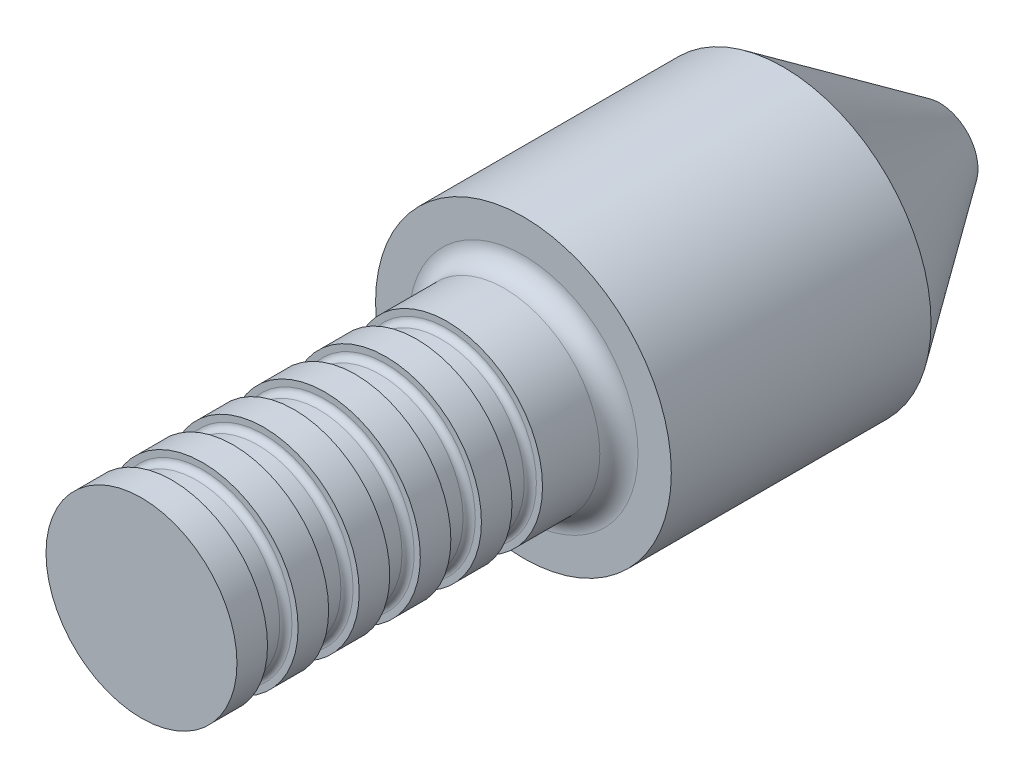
ISO-10303-21;
HEADER;
FILE_DESCRIPTION(('STEP AP214'),'2;1');
FILE_NAME('part.step','',(''),(''),'','','');
FILE_SCHEMA(('AUTOMOTIVE_DESIGN { 1 0 10303 214 1 1 1 1 }'));
ENDSEC;
DATA;
#1=APPLICATION_CONTEXT('core data for automotive mechanical design processes');
#2=APPLICATION_PROTOCOL_DEFINITION('international standard','automotive_design',2000,#1);
#3=PRODUCT_CONTEXT('',#1,'mechanical');
#4=PRODUCT('Part','Part','',(#3));
#5=PRODUCT_RELATED_PRODUCT_CATEGORY('part','',(#4));
#6=PRODUCT_DEFINITION_FORMATION('','',#4);
#7=PRODUCT_DEFINITION_CONTEXT('part definition',#1,'design');
#8=PRODUCT_DEFINITION('design','',#6,#7);
#9=PRODUCT_DEFINITION_SHAPE('','',#8);
#10=(LENGTH_UNIT() NAMED_UNIT(*) SI_UNIT(.MILLI.,.METRE.));
#11=(NAMED_UNIT(*) PLANE_ANGLE_UNIT() SI_UNIT($,.RADIAN.));
#12=(NAMED_UNIT(*) SI_UNIT($,.STERADIAN.) SOLID_ANGLE_UNIT());
#13=UNCERTAINTY_MEASURE_WITH_UNIT(LENGTH_MEASURE(1.E-05),#10,'distance_accuracy_value','');
#14=(GEOMETRIC_REPRESENTATION_CONTEXT(3) GLOBAL_UNCERTAINTY_ASSIGNED_CONTEXT((#13)) GLOBAL_UNIT_ASSIGNED_CONTEXT((#10,
#11,#12)) REPRESENTATION_CONTEXT('',''));
#15=CARTESIAN_POINT('',(0.,0.,0.));
#16=DIRECTION('',(0.,0.,1.));
#17=DIRECTION('',(1.,0.,0.));
#18=AXIS2_PLACEMENT_3D('',#15,#16,#17);
#19=CARTESIAN_POINT('',(0.,0.,-30.6399889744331));
#20=DIRECTION('',(0.,0.,-1.));
#21=DIRECTION('',(-1.,0.,0.));
#22=AXIS2_PLACEMENT_3D('',#19,#20,#21);
#23=CONICAL_SURFACE('',#22,0.,1.02974425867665);
#24=CARTESIAN_POINT('',(0.,0.,-31.5938552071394));
#25=DIRECTION('',(0.,0.,1.));
#26=DIRECTION('',(1.,0.,0.));
#27=AXIS2_PLACEMENT_3D('',#24,#25,#26);
#28=CIRCLE('',#27,1.5875);
#29=CARTESIAN_POINT('',(1.5875,0.,-31.5938552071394));
#30=VERTEX_POINT('',#29);
#31=EDGE_CURVE('E11',#30,#30,#28,.T.);
#32=ORIENTED_EDGE('',*,*,#31,.F.);
#33=EDGE_LOOP('',(#32));
#34=FACE_BOUND('',#33,.T.);
#35=CARTESIAN_POINT('',(0.,0.,-30.6399889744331));
#36=VERTEX_POINT('',#35);
#37=VERTEX_LOOP('',#36);
#38=FACE_BOUND('',#37,.T.);
#39=ADVANCED_FACE('F33',(#34,#38),#23,.F.);
#40=CARTESIAN_POINT('',(0.,0.,0.));
#41=DIRECTION('',(0.,0.,1.));
#42=DIRECTION('',(1.,0.,0.));
#43=AXIS2_PLACEMENT_3D('',#40,#41,#42);
#44=CYLINDRICAL_SURFACE('',#43,1.5875);
#45=CARTESIAN_POINT('',(0.,0.,-33.1813552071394));
#46=DIRECTION('',(0.,0.,1.));
#47=DIRECTION('',(1.,0.,0.));
#48=AXIS2_PLACEMENT_3D('',#45,#46,#47);
#49=CIRCLE('',#48,1.5875);
#50=CARTESIAN_POINT('',(1.5875,0.,-33.1813552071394));
#51=VERTEX_POINT('',#50);
#52=EDGE_CURVE('E39',#51,#51,#49,.T.);
#53=ORIENTED_EDGE('',*,*,#52,.F.);
#54=EDGE_LOOP('',(#53));
#55=FACE_BOUND('',#54,.T.);
#56=ORIENTED_EDGE('',*,*,#31,.T.);
#57=EDGE_LOOP('',(#56));
#58=FACE_BOUND('',#57,.T.);
#59=ADVANCED_FACE('F43',(#55,#58),#44,.F.);
#60=CARTESIAN_POINT('',(0.,0.,-33.1813552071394));
#61=DIRECTION('',(0.,0.,1.));
#62=DIRECTION('',(1.,0.,0.));
#63=AXIS2_PLACEMENT_3D('',#60,#61,#62);
#64=CONICAL_SURFACE('',#63,1.5875,0.61086523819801);
#65=CARTESIAN_POINT('',(0.,0.,-26.67));
#66=DIRECTION('',(0.,0.,1.));
#67=DIRECTION('',(1.,0.,0.));
#68=AXIS2_PLACEMENT_3D('',#65,#66,#67);
#69=CIRCLE('',#68,6.1468);
#70=CARTESIAN_POINT('',(6.1468,0.,-26.67));
#71=VERTEX_POINT('',#70);
#72=EDGE_CURVE('E304',#71,#71,#69,.T.);
#73=CARTESIAN_POINT('',(6.1468,0.,-26.67));
#74=CARTESIAN_POINT('',(6.09930729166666,0.,-26.737826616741));
#75=CARTESIAN_POINT('',(6.05181458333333,0.,-26.8056532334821));
#76=CARTESIAN_POINT('',(5.95682916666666,0.,-26.9413064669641));
#77=CARTESIAN_POINT('',(5.90933645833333,0.,-27.0091330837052));
#78=CARTESIAN_POINT('',(5.81435104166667,0.,-27.1447863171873));
#79=CARTESIAN_POINT('',(5.76685833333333,0.,-27.2126129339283));
#80=CARTESIAN_POINT('',(5.67187291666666,0.,-27.3482661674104));
#81=CARTESIAN_POINT('',(5.62438020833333,0.,-27.4160927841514));
#82=CARTESIAN_POINT('',(5.52939479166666,0.,-27.5517460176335));
#83=CARTESIAN_POINT('',(5.48190208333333,0.,-27.6195726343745));
#84=CARTESIAN_POINT('',(5.38691666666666,0.,-27.7552258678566));
#85=CARTESIAN_POINT('',(5.33942395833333,0.,-27.8230524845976));
#86=CARTESIAN_POINT('',(5.24443854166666,0.,-27.9587057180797));
#87=CARTESIAN_POINT('',(5.19694583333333,0.,-28.0265323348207));
#88=CARTESIAN_POINT('',(5.10196041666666,0.,-28.1621855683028));
#89=CARTESIAN_POINT('',(5.05446770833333,0.,-28.2300121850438));
#90=CARTESIAN_POINT('',(4.95948229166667,0.,-28.3656654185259));
#91=CARTESIAN_POINT('',(4.91198958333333,0.,-28.4334920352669));
#92=CARTESIAN_POINT('',(4.81700416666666,0.,-28.569145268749));
#93=CARTESIAN_POINT('',(4.76951145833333,0.,-28.63697188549));
#94=CARTESIAN_POINT('',(4.67452604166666,0.,-28.7726251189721));
#95=CARTESIAN_POINT('',(4.62703333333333,0.,-28.8404517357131));
#96=CARTESIAN_POINT('',(4.53204791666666,0.,-28.9761049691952));
#97=CARTESIAN_POINT('',(4.48455520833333,0.,-29.0439315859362));
#98=CARTESIAN_POINT('',(4.38956979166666,0.,-29.1795848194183));
#99=CARTESIAN_POINT('',(4.34207708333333,0.,-29.2474114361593));
#100=CARTESIAN_POINT('',(4.24709166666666,0.,-29.3830646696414));
#101=CARTESIAN_POINT('',(4.19959895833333,0.,-29.4508912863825));
#102=CARTESIAN_POINT('',(4.10461354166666,0.,-29.5865445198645));
#103=CARTESIAN_POINT('',(4.05712083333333,0.,-29.6543711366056));
#104=CARTESIAN_POINT('',(3.96213541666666,0.,-29.7900243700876));
#105=CARTESIAN_POINT('',(3.91464270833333,0.,-29.8578509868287));
#106=CARTESIAN_POINT('',(3.81965729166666,0.,-29.9935042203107));
#107=CARTESIAN_POINT('',(3.77216458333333,0.,-30.0613308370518));
#108=CARTESIAN_POINT('',(3.67717916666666,0.,-30.1969840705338));
#109=CARTESIAN_POINT('',(3.62968645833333,0.,-30.2648106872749));
#110=CARTESIAN_POINT('',(3.53470104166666,0.,-30.4004639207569));
#111=CARTESIAN_POINT('',(3.48720833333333,0.,-30.468290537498));
#112=CARTESIAN_POINT('',(3.39222291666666,0.,-30.6039437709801));
#113=CARTESIAN_POINT('',(3.34473020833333,0.,-30.6717703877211));
#114=CARTESIAN_POINT('',(3.24974479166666,0.,-30.8074236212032));
#115=CARTESIAN_POINT('',(3.20225208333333,0.,-30.8752502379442));
#116=CARTESIAN_POINT('',(3.10726666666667,0.,-31.0109034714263));
#117=CARTESIAN_POINT('',(3.05977395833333,0.,-31.0787300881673));
#118=CARTESIAN_POINT('',(2.96478854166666,0.,-31.2143833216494));
#119=CARTESIAN_POINT('',(2.91729583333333,0.,-31.2822099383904));
#120=CARTESIAN_POINT('',(2.82231041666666,0.,-31.4178631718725));
#121=CARTESIAN_POINT('',(2.77481770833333,0.,-31.4856897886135));
#122=CARTESIAN_POINT('',(2.67983229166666,0.,-31.6213430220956));
#123=CARTESIAN_POINT('',(2.63233958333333,0.,-31.6891696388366));
#124=CARTESIAN_POINT('',(2.53735416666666,0.,-31.8248228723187));
#125=CARTESIAN_POINT('',(2.48986145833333,0.,-31.8926494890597));
#126=CARTESIAN_POINT('',(2.39487604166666,0.,-32.0283027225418));
#127=CARTESIAN_POINT('',(2.34738333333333,0.,-32.0961293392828));
#128=CARTESIAN_POINT('',(2.25239791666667,0.,-32.2317825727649));
#129=CARTESIAN_POINT('',(2.20490520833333,0.,-32.2996091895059));
#130=CARTESIAN_POINT('',(2.10991979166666,0.,-32.435262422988));
#131=CARTESIAN_POINT('',(2.06242708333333,0.,-32.5030890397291));
#132=CARTESIAN_POINT('',(1.96744166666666,0.,-32.6387422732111));
#133=CARTESIAN_POINT('',(1.91994895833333,0.,-32.7065688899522));
#134=CARTESIAN_POINT('',(1.82496354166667,0.,-32.8422221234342));
#135=CARTESIAN_POINT('',(1.77747083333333,0.,-32.9100487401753));
#136=CARTESIAN_POINT('',(1.68248541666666,0.,-33.0457019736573));
#137=CARTESIAN_POINT('',(1.63499270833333,0.,-33.1135285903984));
#138=CARTESIAN_POINT('',(1.5875,0.,-33.1813552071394));
#139=B_SPLINE_CURVE_WITH_KNOTS('',3,(#73,#74,#75,#76,#77,#78,#79,#80,#81,#82,#83,#84,#85,#86,
#87,#88,#89,#90,#91,#92,#93,#94,#95,#96,#97,#98,#99,#100,#101,#102,#103,#104,#105,#106,#107,
#108,#109,#110,#111,#112,#113,#114,#115,#116,#117,#118,#119,#120,#121,#122,#123,#124,#125,#126,
#127,#128,#129,#130,#131,#132,#133,#134,#135,#136,#137,#138),.UNSPECIFIED.,.F.,.F.,(4,2,2,2,2,2,
2,2,2,2,2,2,2,2,2,2,2,2,2,2,2,2,2,2,2,2,2,2,2,2,2,2,4),(0.,0.248403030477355,0.496806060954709,
0.745209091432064,0.993612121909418,1.24201515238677,1.49041818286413,1.73882121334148,
1.98722424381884,2.23562727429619,2.48403030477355,2.7324333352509,2.98083636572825,
3.22923939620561,3.47764242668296,3.72604545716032,3.97444848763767,4.22285151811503,
4.47125454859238,4.71965757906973,4.96806060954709,5.21646364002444,5.4648666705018,
5.71326970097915,5.9616727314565,6.21007576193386,6.45847879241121,6.70688182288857,
6.95528485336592,7.20368788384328,7.45209091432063,7.70049394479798,7.94889697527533),.UNSPECIFIED.);
#140=EDGE_CURVE('BSEAM48',#71,#51,#139,.T.);
#141=ORIENTED_EDGE('',*,*,#72,.F.);
#142=ORIENTED_EDGE('',*,*,#52,.T.);
#143=ORIENTED_EDGE('',*,*,#140,.T.);
#144=ORIENTED_EDGE('',*,*,#140,.F.);
#145=EDGE_LOOP('',(#141,#143,#142,#144));
#146=FACE_BOUND('',#145,.T.);
#147=ADVANCED_FACE('F48',(#146),#64,.T.);
#148=CARTESIAN_POINT('',(0.,0.,0.));
#149=DIRECTION('',(0.,0.,1.));
#150=DIRECTION('',(1.,0.,0.));
#151=AXIS2_PLACEMENT_3D('',#148,#149,#150);
#152=CYLINDRICAL_SURFACE('',#151,6.1468);
#153=CARTESIAN_POINT('',(0.,0.,-15.875));
#154=DIRECTION('',(0.,0.,1.));
#155=DIRECTION('',(1.,0.,0.));
#156=AXIS2_PLACEMENT_3D('',#153,#154,#155);
#157=CIRCLE('',#156,6.1468);
#158=CARTESIAN_POINT('',(6.1468,0.,-15.875));
#159=VERTEX_POINT('',#158);
#160=EDGE_CURVE('E301',#159,#159,#157,.T.);
#161=ORIENTED_EDGE('',*,*,#160,.F.);
#162=EDGE_LOOP('',(#161));
#163=FACE_BOUND('',#162,.T.);
#164=ORIENTED_EDGE('',*,*,#72,.T.);
#165=EDGE_LOOP('',(#164));
#166=FACE_BOUND('',#165,.T.);
#167=ADVANCED_FACE('F55',(#163,#166),#152,.T.);
#168=CARTESIAN_POINT('',(0.,4.7625,-15.875));
#169=DIRECTION('',(0.,0.,-1.));
#170=DIRECTION('',(-1.,0.,0.));
#171=AXIS2_PLACEMENT_3D('',#168,#169,#170);
#172=PLANE('',#171);
#173=CARTESIAN_POINT('',(0.,0.,-15.875));
#174=DIRECTION('',(0.,0.,1.));
#175=DIRECTION('',(1.,0.,0.));
#176=AXIS2_PLACEMENT_3D('',#173,#174,#175);
#177=CIRCLE('',#176,4.7625);
#178=CARTESIAN_POINT('',(4.7625,0.,-15.875));
#179=VERTEX_POINT('',#178);
#180=EDGE_CURVE('E298',#179,#179,#177,.T.);
#181=ORIENTED_EDGE('',*,*,#180,.F.);
#182=EDGE_LOOP('',(#181));
#183=FACE_BOUND('',#182,.T.);
#184=ORIENTED_EDGE('',*,*,#160,.T.);
#185=EDGE_LOOP('',(#184));
#186=FACE_BOUND('',#185,.T.);
#187=ADVANCED_FACE('F62',(#183,#186),#172,.F.);
#188=CARTESIAN_POINT('',(0.,0.,-15.08125));
#189=DIRECTION('',(0.,0.,1.));
#190=DIRECTION('',(1.,0.,0.));
#191=AXIS2_PLACEMENT_3D('',#188,#189,#190);
#192=TOROIDAL_SURFACE('',#191,4.7625,0.793750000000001);
#193=CARTESIAN_POINT('',(0.,0.,-15.08125));
#194=DIRECTION('',(0.,0.,1.));
#195=DIRECTION('',(1.,0.,0.));
#196=AXIS2_PLACEMENT_3D('',#193,#194,#195);
#197=CIRCLE('',#196,3.96875);
#198=CARTESIAN_POINT('',(3.96875,0.,-15.08125));
#199=VERTEX_POINT('',#198);
#200=EDGE_CURVE('E295',#199,#199,#197,.T.);
#201=ORIENTED_EDGE('',*,*,#200,.F.);
#202=EDGE_LOOP('',(#201));
#203=FACE_BOUND('',#202,.T.);
#204=ORIENTED_EDGE('',*,*,#180,.T.);
#205=EDGE_LOOP('',(#204));
#206=FACE_BOUND('',#205,.T.);
#207=ADVANCED_FACE('F66',(#203,#206),#192,.F.);
#208=CARTESIAN_POINT('',(0.,0.,0.));
#209=DIRECTION('',(0.,0.,1.));
#210=DIRECTION('',(1.,0.,0.));
#211=AXIS2_PLACEMENT_3D('',#208,#209,#210);
#212=CYLINDRICAL_SURFACE('',#211,3.96875);
#213=CARTESIAN_POINT('',(0.,0.,-12.7));
#214=DIRECTION('',(0.,0.,1.));
#215=DIRECTION('',(1.,0.,0.));
#216=AXIS2_PLACEMENT_3D('',#213,#214,#215);
#217=CIRCLE('',#216,3.96875);
#218=CARTESIAN_POINT('',(3.96875,0.,-12.7));
#219=VERTEX_POINT('',#218);
#220=EDGE_CURVE('E292',#219,#219,#217,.T.);
#221=ORIENTED_EDGE('',*,*,#220,.F.);
#222=EDGE_LOOP('',(#221));
#223=FACE_BOUND('',#222,.T.);
#224=ORIENTED_EDGE('',*,*,#200,.T.);
#225=EDGE_LOOP('',(#224));
#226=FACE_BOUND('',#225,.T.);
#227=ADVANCED_FACE('F70',(#223,#226),#212,.T.);
#228=CARTESIAN_POINT('',(0.,3.71475,-12.7));
#229=DIRECTION('',(0.,0.,-1.));
#230=DIRECTION('',(-1.,0.,0.));
#231=AXIS2_PLACEMENT_3D('',#228,#229,#230);
#232=PLANE('',#231);
#233=CARTESIAN_POINT('',(0.,0.,-12.7));
#234=DIRECTION('',(0.,0.,1.));
#235=DIRECTION('',(1.,0.,0.));
#236=AXIS2_PLACEMENT_3D('',#233,#234,#235);
#237=CIRCLE('',#236,3.71475);
#238=CARTESIAN_POINT('',(3.71475,0.,-12.7));
#239=VERTEX_POINT('',#238);
#240=EDGE_CURVE('E289',#239,#239,#237,.T.);
#241=ORIENTED_EDGE('',*,*,#240,.F.);
#242=EDGE_LOOP('',(#241));
#243=FACE_BOUND('',#242,.T.);
#244=ORIENTED_EDGE('',*,*,#220,.T.);
#245=EDGE_LOOP('',(#244));
#246=FACE_BOUND('',#245,.T.);
#247=ADVANCED_FACE('F74',(#243,#246),#232,.F.);
#248=CARTESIAN_POINT('',(0.,0.,-12.446));
#249=DIRECTION('',(0.,0.,1.));
#250=DIRECTION('',(1.,0.,0.));
#251=AXIS2_PLACEMENT_3D('',#248,#249,#250);
#252=TOROIDAL_SURFACE('',#251,3.71475,0.254);
#253=CARTESIAN_POINT('',(0.,0.,-12.446));
#254=DIRECTION('',(0.,0.,1.));
#255=DIRECTION('',(1.,0.,0.));
#256=AXIS2_PLACEMENT_3D('',#253,#254,#255);
#257=CIRCLE('',#256,3.46075);
#258=CARTESIAN_POINT('',(3.46075,0.,-12.446));
#259=VERTEX_POINT('',#258);
#260=EDGE_CURVE('E286',#259,#259,#257,.T.);
#261=ORIENTED_EDGE('',*,*,#260,.F.);
#262=EDGE_LOOP('',(#261));
#263=FACE_BOUND('',#262,.T.);
#264=ORIENTED_EDGE('',*,*,#240,.T.);
#265=EDGE_LOOP('',(#264));
#266=FACE_BOUND('',#265,.T.);
#267=ADVANCED_FACE('F78',(#263,#266),#252,.F.);
#268=CARTESIAN_POINT('',(0.,0.,0.));
#269=DIRECTION('',(0.,0.,1.));
#270=DIRECTION('',(1.,0.,0.));
#271=AXIS2_PLACEMENT_3D('',#268,#269,#270);
#272=CYLINDRICAL_SURFACE('',#271,3.46075);
#273=CARTESIAN_POINT('',(0.,0.,-11.684));
#274=DIRECTION('',(0.,0.,1.));
#275=DIRECTION('',(1.,0.,0.));
#276=AXIS2_PLACEMENT_3D('',#273,#274,#275);
#277=CIRCLE('',#276,3.46075);
#278=CARTESIAN_POINT('',(3.46075,0.,-11.684));
#279=VERTEX_POINT('',#278);
#280=EDGE_CURVE('E283',#279,#279,#277,.T.);
#281=ORIENTED_EDGE('',*,*,#280,.F.);
#282=EDGE_LOOP('',(#281));
#283=FACE_BOUND('',#282,.T.);
#284=ORIENTED_EDGE('',*,*,#260,.T.);
#285=EDGE_LOOP('',(#284));
#286=FACE_BOUND('',#285,.T.);
#287=ADVANCED_FACE('F82',(#283,#286),#272,.T.);
#288=CARTESIAN_POINT('',(0.,0.,-11.684));
#289=DIRECTION('',(0.,0.,1.));
#290=DIRECTION('',(1.,0.,0.));
#291=AXIS2_PLACEMENT_3D('',#288,#289,#290);
#292=TOROIDAL_SURFACE('',#291,3.71475,0.254);
#293=CARTESIAN_POINT('',(0.,0.,-11.43));
#294=DIRECTION('',(0.,0.,1.));
#295=DIRECTION('',(1.,0.,0.));
#296=AXIS2_PLACEMENT_3D('',#293,#294,#295);
#297=CIRCLE('',#296,3.71475);
#298=CARTESIAN_POINT('',(3.71475,0.,-11.43));
#299=VERTEX_POINT('',#298);
#300=EDGE_CURVE('E280',#299,#299,#297,.T.);
#301=ORIENTED_EDGE('',*,*,#300,.F.);
#302=EDGE_LOOP('',(#301));
#303=FACE_BOUND('',#302,.T.);
#304=ORIENTED_EDGE('',*,*,#280,.T.);
#305=EDGE_LOOP('',(#304));
#306=FACE_BOUND('',#305,.T.);
#307=ADVANCED_FACE('F86',(#303,#306),#292,.F.);
#308=CARTESIAN_POINT('',(0.,3.96875,-11.43));
#309=DIRECTION('',(0.,0.,1.));
#310=DIRECTION('',(1.,0.,0.));
#311=AXIS2_PLACEMENT_3D('',#308,#309,#310);
#312=PLANE('',#311);
#313=CARTESIAN_POINT('',(0.,0.,-11.43));
#314=DIRECTION('',(0.,0.,1.));
#315=DIRECTION('',(1.,0.,0.));
#316=AXIS2_PLACEMENT_3D('',#313,#314,#315);
#317=CIRCLE('',#316,3.96875);
#318=CARTESIAN_POINT('',(3.96875,0.,-11.43));
#319=VERTEX_POINT('',#318);
#320=EDGE_CURVE('E277',#319,#319,#317,.T.);
#321=ORIENTED_EDGE('',*,*,#320,.F.);
#322=EDGE_LOOP('',(#321));
#323=FACE_BOUND('',#322,.T.);
#324=ORIENTED_EDGE('',*,*,#300,.T.);
#325=EDGE_LOOP('',(#324));
#326=FACE_BOUND('',#325,.T.);
#327=ADVANCED_FACE('F90',(#323,#326),#312,.F.);
#328=CARTESIAN_POINT('',(0.,0.,0.));
#329=DIRECTION('',(0.,0.,1.));
#330=DIRECTION('',(1.,0.,0.));
#331=AXIS2_PLACEMENT_3D('',#328,#329,#330);
#332=CYLINDRICAL_SURFACE('',#331,3.96875);
#333=CARTESIAN_POINT('',(0.,0.,-10.16));
#334=DIRECTION('',(0.,0.,1.));
#335=DIRECTION('',(1.,0.,0.));
#336=AXIS2_PLACEMENT_3D('',#333,#334,#335);
#337=CIRCLE('',#336,3.96875);
#338=CARTESIAN_POINT('',(3.96875,0.,-10.16));
#339=VERTEX_POINT('',#338);
#340=EDGE_CURVE('E274',#339,#339,#337,.T.);
#341=ORIENTED_EDGE('',*,*,#340,.F.);
#342=EDGE_LOOP('',(#341));
#343=FACE_BOUND('',#342,.T.);
#344=ORIENTED_EDGE('',*,*,#320,.T.);
#345=EDGE_LOOP('',(#344));
#346=FACE_BOUND('',#345,.T.);
#347=ADVANCED_FACE('F94',(#343,#346),#332,.T.);
#348=CARTESIAN_POINT('',(0.,3.71475,-10.16));
#349=DIRECTION('',(0.,0.,-1.));
#350=DIRECTION('',(-1.,0.,0.));
#351=AXIS2_PLACEMENT_3D('',#348,#349,#350);
#352=PLANE('',#351);
#353=CARTESIAN_POINT('',(0.,0.,-10.16));
#354=DIRECTION('',(0.,0.,1.));
#355=DIRECTION('',(1.,0.,0.));
#356=AXIS2_PLACEMENT_3D('',#353,#354,#355);
#357=CIRCLE('',#356,3.71475);
#358=CARTESIAN_POINT('',(3.71475,0.,-10.16));
#359=VERTEX_POINT('',#358);
#360=EDGE_CURVE('E271',#359,#359,#357,.T.);
#361=ORIENTED_EDGE('',*,*,#360,.F.);
#362=EDGE_LOOP('',(#361));
#363=FACE_BOUND('',#362,.T.);
#364=ORIENTED_EDGE('',*,*,#340,.T.);
#365=EDGE_LOOP('',(#364));
#366=FACE_BOUND('',#365,.T.);
#367=ADVANCED_FACE('F98',(#363,#366),#352,.F.);
#368=CARTESIAN_POINT('',(0.,0.,-9.906));
#369=DIRECTION('',(0.,0.,1.));
#370=DIRECTION('',(1.,0.,0.));
#371=AXIS2_PLACEMENT_3D('',#368,#369,#370);
#372=TOROIDAL_SURFACE('',#371,3.71475,0.254000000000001);
#373=CARTESIAN_POINT('',(0.,0.,-9.906));
#374=DIRECTION('',(0.,0.,1.));
#375=DIRECTION('',(1.,0.,0.));
#376=AXIS2_PLACEMENT_3D('',#373,#374,#375);
#377=CIRCLE('',#376,3.46075);
#378=CARTESIAN_POINT('',(3.46075,0.,-9.906));
#379=VERTEX_POINT('',#378);
#380=EDGE_CURVE('E268',#379,#379,#377,.T.);
#381=ORIENTED_EDGE('',*,*,#380,.F.);
#382=EDGE_LOOP('',(#381));
#383=FACE_BOUND('',#382,.T.);
#384=ORIENTED_EDGE('',*,*,#360,.T.);
#385=EDGE_LOOP('',(#384));
#386=FACE_BOUND('',#385,.T.);
#387=ADVANCED_FACE('F102',(#383,#386),#372,.F.);
#388=CARTESIAN_POINT('',(0.,0.,0.));
#389=DIRECTION('',(0.,0.,1.));
#390=DIRECTION('',(1.,0.,0.));
#391=AXIS2_PLACEMENT_3D('',#388,#389,#390);
#392=CYLINDRICAL_SURFACE('',#391,3.46075);
#393=CARTESIAN_POINT('',(0.,0.,-9.144));
#394=DIRECTION('',(0.,0.,1.));
#395=DIRECTION('',(1.,0.,0.));
#396=AXIS2_PLACEMENT_3D('',#393,#394,#395);
#397=CIRCLE('',#396,3.46075);
#398=CARTESIAN_POINT('',(3.46075,0.,-9.144));
#399=VERTEX_POINT('',#398);
#400=EDGE_CURVE('E265',#399,#399,#397,.T.);
#401=ORIENTED_EDGE('',*,*,#400,.F.);
#402=EDGE_LOOP('',(#401));
#403=FACE_BOUND('',#402,.T.);
#404=ORIENTED_EDGE('',*,*,#380,.T.);
#405=EDGE_LOOP('',(#404));
#406=FACE_BOUND('',#405,.T.);
#407=ADVANCED_FACE('F106',(#403,#406),#392,.T.);
#408=CARTESIAN_POINT('',(0.,0.,-9.144));
#409=DIRECTION('',(0.,0.,1.));
#410=DIRECTION('',(1.,0.,0.));
#411=AXIS2_PLACEMENT_3D('',#408,#409,#410);
#412=TOROIDAL_SURFACE('',#411,3.71475,0.253999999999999);
#413=CARTESIAN_POINT('',(0.,0.,-8.89));
#414=DIRECTION('',(0.,0.,1.));
#415=DIRECTION('',(1.,0.,0.));
#416=AXIS2_PLACEMENT_3D('',#413,#414,#415);
#417=CIRCLE('',#416,3.71475);
#418=CARTESIAN_POINT('',(3.71475,0.,-8.89));
#419=VERTEX_POINT('',#418);
#420=EDGE_CURVE('E262',#419,#419,#417,.T.);
#421=ORIENTED_EDGE('',*,*,#420,.F.);
#422=EDGE_LOOP('',(#421));
#423=FACE_BOUND('',#422,.T.);
#424=ORIENTED_EDGE('',*,*,#400,.T.);
#425=EDGE_LOOP('',(#424));
#426=FACE_BOUND('',#425,.T.);
#427=ADVANCED_FACE('F110',(#423,#426),#412,.F.);
#428=CARTESIAN_POINT('',(0.,3.96875,-8.89));
#429=DIRECTION('',(0.,0.,1.));
#430=DIRECTION('',(1.,0.,0.));
#431=AXIS2_PLACEMENT_3D('',#428,#429,#430);
#432=PLANE('',#431);
#433=CARTESIAN_POINT('',(0.,0.,-8.89));
#434=DIRECTION('',(0.,0.,1.));
#435=DIRECTION('',(1.,0.,0.));
#436=AXIS2_PLACEMENT_3D('',#433,#434,#435);
#437=CIRCLE('',#436,3.96875);
#438=CARTESIAN_POINT('',(3.96875,0.,-8.89));
#439=VERTEX_POINT('',#438);
#440=EDGE_CURVE('E259',#439,#439,#437,.T.);
#441=ORIENTED_EDGE('',*,*,#440,.F.);
#442=EDGE_LOOP('',(#441));
#443=FACE_BOUND('',#442,.T.);
#444=ORIENTED_EDGE('',*,*,#420,.T.);
#445=EDGE_LOOP('',(#444));
#446=FACE_BOUND('',#445,.T.);
#447=ADVANCED_FACE('F114',(#443,#446),#432,.F.);
#448=CARTESIAN_POINT('',(0.,0.,0.));
#449=DIRECTION('',(0.,0.,1.));
#450=DIRECTION('',(1.,0.,0.));
#451=AXIS2_PLACEMENT_3D('',#448,#449,#450);
#452=CYLINDRICAL_SURFACE('',#451,3.96875);
#453=CARTESIAN_POINT('',(0.,0.,-7.62));
#454=DIRECTION('',(0.,0.,1.));
#455=DIRECTION('',(1.,0.,0.));
#456=AXIS2_PLACEMENT_3D('',#453,#454,#455);
#457=CIRCLE('',#456,3.96875);
#458=CARTESIAN_POINT('',(3.96875,0.,-7.62));
#459=VERTEX_POINT('',#458);
#460=EDGE_CURVE('E256',#459,#459,#457,.T.);
#461=ORIENTED_EDGE('',*,*,#460,.F.);
#462=EDGE_LOOP('',(#461));
#463=FACE_BOUND('',#462,.T.);
#464=ORIENTED_EDGE('',*,*,#440,.T.);
#465=EDGE_LOOP('',(#464));
#466=FACE_BOUND('',#465,.T.);
#467=ADVANCED_FACE('F118',(#463,#466),#452,.T.);
#468=CARTESIAN_POINT('',(0.,3.71475,-7.62));
#469=DIRECTION('',(0.,0.,-1.));
#470=DIRECTION('',(-1.,0.,0.));
#471=AXIS2_PLACEMENT_3D('',#468,#469,#470);
#472=PLANE('',#471);
#473=CARTESIAN_POINT('',(0.,0.,-7.62));
#474=DIRECTION('',(0.,0.,1.));
#475=DIRECTION('',(1.,0.,0.));
#476=AXIS2_PLACEMENT_3D('',#473,#474,#475);
#477=CIRCLE('',#476,3.71475);
#478=CARTESIAN_POINT('',(3.71475,0.,-7.62));
#479=VERTEX_POINT('',#478);
#480=EDGE_CURVE('E253',#479,#479,#477,.T.);
#481=ORIENTED_EDGE('',*,*,#480,.F.);
#482=EDGE_LOOP('',(#481));
#483=FACE_BOUND('',#482,.T.);
#484=ORIENTED_EDGE('',*,*,#460,.T.);
#485=EDGE_LOOP('',(#484));
#486=FACE_BOUND('',#485,.T.);
#487=ADVANCED_FACE('F122',(#483,#486),#472,.F.);
#488=CARTESIAN_POINT('',(0.,0.,-7.366));
#489=DIRECTION('',(0.,0.,1.));
#490=DIRECTION('',(1.,0.,0.));
#491=AXIS2_PLACEMENT_3D('',#488,#489,#490);
#492=TOROIDAL_SURFACE('',#491,3.71475,0.254);
#493=CARTESIAN_POINT('',(0.,0.,-7.366));
#494=DIRECTION('',(0.,0.,1.));
#495=DIRECTION('',(1.,0.,0.));
#496=AXIS2_PLACEMENT_3D('',#493,#494,#495);
#497=CIRCLE('',#496,3.46075);
#498=CARTESIAN_POINT('',(3.46075,0.,-7.366));
#499=VERTEX_POINT('',#498);
#500=EDGE_CURVE('E250',#499,#499,#497,.T.);
#501=ORIENTED_EDGE('',*,*,#500,.F.);
#502=EDGE_LOOP('',(#501));
#503=FACE_BOUND('',#502,.T.);
#504=ORIENTED_EDGE('',*,*,#480,.T.);
#505=EDGE_LOOP('',(#504));
#506=FACE_BOUND('',#505,.T.);
#507=ADVANCED_FACE('F126',(#503,#506),#492,.F.);
#508=CARTESIAN_POINT('',(0.,0.,0.));
#509=DIRECTION('',(0.,0.,1.));
#510=DIRECTION('',(1.,0.,0.));
#511=AXIS2_PLACEMENT_3D('',#508,#509,#510);
#512=CYLINDRICAL_SURFACE('',#511,3.46075);
#513=CARTESIAN_POINT('',(0.,0.,-6.604));
#514=DIRECTION('',(0.,0.,1.));
#515=DIRECTION('',(1.,0.,0.));
#516=AXIS2_PLACEMENT_3D('',#513,#514,#515);
#517=CIRCLE('',#516,3.46075);
#518=CARTESIAN_POINT('',(3.46075,0.,-6.604));
#519=VERTEX_POINT('',#518);
#520=EDGE_CURVE('E247',#519,#519,#517,.T.);
#521=ORIENTED_EDGE('',*,*,#520,.F.);
#522=EDGE_LOOP('',(#521));
#523=FACE_BOUND('',#522,.T.);
#524=ORIENTED_EDGE('',*,*,#500,.T.);
#525=EDGE_LOOP('',(#524));
#526=FACE_BOUND('',#525,.T.);
#527=ADVANCED_FACE('F130',(#523,#526),#512,.T.);
#528=CARTESIAN_POINT('',(0.,0.,-6.604));
#529=DIRECTION('',(0.,0.,1.));
#530=DIRECTION('',(1.,0.,0.));
#531=AXIS2_PLACEMENT_3D('',#528,#529,#530);
#532=TOROIDAL_SURFACE('',#531,3.71475,0.254);
#533=CARTESIAN_POINT('',(0.,0.,-6.35));
#534=DIRECTION('',(0.,0.,1.));
#535=DIRECTION('',(1.,0.,0.));
#536=AXIS2_PLACEMENT_3D('',#533,#534,#535);
#537=CIRCLE('',#536,3.71475);
#538=CARTESIAN_POINT('',(3.71475,0.,-6.35));
#539=VERTEX_POINT('',#538);
#540=EDGE_CURVE('E244',#539,#539,#537,.T.);
#541=ORIENTED_EDGE('',*,*,#540,.F.);
#542=EDGE_LOOP('',(#541));
#543=FACE_BOUND('',#542,.T.);
#544=ORIENTED_EDGE('',*,*,#520,.T.);
#545=EDGE_LOOP('',(#544));
#546=FACE_BOUND('',#545,.T.);
#547=ADVANCED_FACE('F134',(#543,#546),#532,.F.);
#548=CARTESIAN_POINT('',(0.,3.96875,-6.35));
#549=DIRECTION('',(0.,0.,1.));
#550=DIRECTION('',(1.,0.,0.));
#551=AXIS2_PLACEMENT_3D('',#548,#549,#550);
#552=PLANE('',#551);
#553=CARTESIAN_POINT('',(0.,0.,-6.35));
#554=DIRECTION('',(0.,0.,1.));
#555=DIRECTION('',(1.,0.,0.));
#556=AXIS2_PLACEMENT_3D('',#553,#554,#555);
#557=CIRCLE('',#556,3.96875);
#558=CARTESIAN_POINT('',(3.96875,0.,-6.35));
#559=VERTEX_POINT('',#558);
#560=EDGE_CURVE('E241',#559,#559,#557,.T.);
#561=ORIENTED_EDGE('',*,*,#560,.F.);
#562=EDGE_LOOP('',(#561));
#563=FACE_BOUND('',#562,.T.);
#564=ORIENTED_EDGE('',*,*,#540,.T.);
#565=EDGE_LOOP('',(#564));
#566=FACE_BOUND('',#565,.T.);
#567=ADVANCED_FACE('F138',(#563,#566),#552,.F.);
#568=CARTESIAN_POINT('',(0.,0.,0.));
#569=DIRECTION('',(0.,0.,1.));
#570=DIRECTION('',(1.,0.,0.));
#571=AXIS2_PLACEMENT_3D('',#568,#569,#570);
#572=CYLINDRICAL_SURFACE('',#571,3.96875);
#573=CARTESIAN_POINT('',(0.,0.,-5.08));
#574=DIRECTION('',(0.,0.,1.));
#575=DIRECTION('',(1.,0.,0.));
#576=AXIS2_PLACEMENT_3D('',#573,#574,#575);
#577=CIRCLE('',#576,3.96875);
#578=CARTESIAN_POINT('',(3.96875,0.,-5.08));
#579=VERTEX_POINT('',#578);
#580=EDGE_CURVE('E238',#579,#579,#577,.T.);
#581=ORIENTED_EDGE('',*,*,#580,.F.);
#582=EDGE_LOOP('',(#581));
#583=FACE_BOUND('',#582,.T.);
#584=ORIENTED_EDGE('',*,*,#560,.T.);
#585=EDGE_LOOP('',(#584));
#586=FACE_BOUND('',#585,.T.);
#587=ADVANCED_FACE('F142',(#583,#586),#572,.T.);
#588=CARTESIAN_POINT('',(0.,3.71475,-5.08));
#589=DIRECTION('',(0.,0.,-1.));
#590=DIRECTION('',(-1.,0.,0.));
#591=AXIS2_PLACEMENT_3D('',#588,#589,#590);
#592=PLANE('',#591);
#593=CARTESIAN_POINT('',(0.,0.,-5.08));
#594=DIRECTION('',(0.,0.,1.));
#595=DIRECTION('',(1.,0.,0.));
#596=AXIS2_PLACEMENT_3D('',#593,#594,#595);
#597=CIRCLE('',#596,3.71475);
#598=CARTESIAN_POINT('',(3.71475,0.,-5.08));
#599=VERTEX_POINT('',#598);
#600=EDGE_CURVE('E235',#599,#599,#597,.T.);
#601=ORIENTED_EDGE('',*,*,#600,.F.);
#602=EDGE_LOOP('',(#601));
#603=FACE_BOUND('',#602,.T.);
#604=ORIENTED_EDGE('',*,*,#580,.T.);
#605=EDGE_LOOP('',(#604));
#606=FACE_BOUND('',#605,.T.);
#607=ADVANCED_FACE('F146',(#603,#606),#592,.F.);
#608=CARTESIAN_POINT('',(0.,0.,-4.826));
#609=DIRECTION('',(0.,0.,1.));
#610=DIRECTION('',(1.,0.,0.));
#611=AXIS2_PLACEMENT_3D('',#608,#609,#610);
#612=TOROIDAL_SURFACE('',#611,3.71475,0.254);
#613=CARTESIAN_POINT('',(0.,0.,-4.826));
#614=DIRECTION('',(0.,0.,1.));
#615=DIRECTION('',(1.,0.,0.));
#616=AXIS2_PLACEMENT_3D('',#613,#614,#615);
#617=CIRCLE('',#616,3.46075);
#618=CARTESIAN_POINT('',(3.46075,0.,-4.826));
#619=VERTEX_POINT('',#618);
#620=EDGE_CURVE('E232',#619,#619,#617,.T.);
#621=ORIENTED_EDGE('',*,*,#620,.F.);
#622=EDGE_LOOP('',(#621));
#623=FACE_BOUND('',#622,.T.);
#624=ORIENTED_EDGE('',*,*,#600,.T.);
#625=EDGE_LOOP('',(#624));
#626=FACE_BOUND('',#625,.T.);
#627=ADVANCED_FACE('F150',(#623,#626),#612,.F.);
#628=CARTESIAN_POINT('',(0.,0.,0.));
#629=DIRECTION('',(0.,0.,1.));
#630=DIRECTION('',(1.,0.,0.));
#631=AXIS2_PLACEMENT_3D('',#628,#629,#630);
#632=CYLINDRICAL_SURFACE('',#631,3.46075);
#633=CARTESIAN_POINT('',(0.,0.,-4.064));
#634=DIRECTION('',(0.,0.,1.));
#635=DIRECTION('',(1.,0.,0.));
#636=AXIS2_PLACEMENT_3D('',#633,#634,#635);
#637=CIRCLE('',#636,3.46075);
#638=CARTESIAN_POINT('',(3.46075,0.,-4.064));
#639=VERTEX_POINT('',#638);
#640=EDGE_CURVE('E229',#639,#639,#637,.T.);
#641=ORIENTED_EDGE('',*,*,#640,.F.);
#642=EDGE_LOOP('',(#641));
#643=FACE_BOUND('',#642,.T.);
#644=ORIENTED_EDGE('',*,*,#620,.T.);
#645=EDGE_LOOP('',(#644));
#646=FACE_BOUND('',#645,.T.);
#647=ADVANCED_FACE('F154',(#643,#646),#632,.T.);
#648=CARTESIAN_POINT('',(0.,0.,-4.064));
#649=DIRECTION('',(0.,0.,1.));
#650=DIRECTION('',(1.,0.,0.));
#651=AXIS2_PLACEMENT_3D('',#648,#649,#650);
#652=TOROIDAL_SURFACE('',#651,3.71475,0.254);
#653=CARTESIAN_POINT('',(0.,0.,-3.81));
#654=DIRECTION('',(0.,0.,1.));
#655=DIRECTION('',(1.,0.,0.));
#656=AXIS2_PLACEMENT_3D('',#653,#654,#655);
#657=CIRCLE('',#656,3.71475);
#658=CARTESIAN_POINT('',(3.71475,0.,-3.81));
#659=VERTEX_POINT('',#658);
#660=EDGE_CURVE('E226',#659,#659,#657,.T.);
#661=ORIENTED_EDGE('',*,*,#660,.F.);
#662=EDGE_LOOP('',(#661));
#663=FACE_BOUND('',#662,.T.);
#664=ORIENTED_EDGE('',*,*,#640,.T.);
#665=EDGE_LOOP('',(#664));
#666=FACE_BOUND('',#665,.T.);
#667=ADVANCED_FACE('F158',(#663,#666),#652,.F.);
#668=CARTESIAN_POINT('',(0.,3.96875,-3.81));
#669=DIRECTION('',(0.,0.,1.));
#670=DIRECTION('',(1.,0.,0.));
#671=AXIS2_PLACEMENT_3D('',#668,#669,#670);
#672=PLANE('',#671);
#673=CARTESIAN_POINT('',(0.,0.,-3.81));
#674=DIRECTION('',(0.,0.,1.));
#675=DIRECTION('',(1.,0.,0.));
#676=AXIS2_PLACEMENT_3D('',#673,#674,#675);
#677=CIRCLE('',#676,3.96875);
#678=CARTESIAN_POINT('',(3.96875,0.,-3.81));
#679=VERTEX_POINT('',#678);
#680=EDGE_CURVE('E223',#679,#679,#677,.T.);
#681=ORIENTED_EDGE('',*,*,#680,.F.);
#682=EDGE_LOOP('',(#681));
#683=FACE_BOUND('',#682,.T.);
#684=ORIENTED_EDGE('',*,*,#660,.T.);
#685=EDGE_LOOP('',(#684));
#686=FACE_BOUND('',#685,.T.);
#687=ADVANCED_FACE('F162',(#683,#686),#672,.F.);
#688=CARTESIAN_POINT('',(0.,0.,0.));
#689=DIRECTION('',(0.,0.,1.));
#690=DIRECTION('',(1.,0.,0.));
#691=AXIS2_PLACEMENT_3D('',#688,#689,#690);
#692=CYLINDRICAL_SURFACE('',#691,3.96875);
#693=CARTESIAN_POINT('',(0.,0.,-2.54));
#694=DIRECTION('',(0.,0.,1.));
#695=DIRECTION('',(1.,0.,0.));
#696=AXIS2_PLACEMENT_3D('',#693,#694,#695);
#697=CIRCLE('',#696,3.96875);
#698=CARTESIAN_POINT('',(3.96875,0.,-2.54));
#699=VERTEX_POINT('',#698);
#700=EDGE_CURVE('E220',#699,#699,#697,.T.);
#701=ORIENTED_EDGE('',*,*,#700,.F.);
#702=EDGE_LOOP('',(#701));
#703=FACE_BOUND('',#702,.T.);
#704=ORIENTED_EDGE('',*,*,#680,.T.);
#705=EDGE_LOOP('',(#704));
#706=FACE_BOUND('',#705,.T.);
#707=ADVANCED_FACE('F166',(#703,#706),#692,.T.);
#708=CARTESIAN_POINT('',(0.,3.71475,-2.54));
#709=DIRECTION('',(0.,0.,-1.));
#710=DIRECTION('',(-1.,0.,0.));
#711=AXIS2_PLACEMENT_3D('',#708,#709,#710);
#712=PLANE('',#711);
#713=CARTESIAN_POINT('',(0.,0.,-2.54));
#714=DIRECTION('',(0.,0.,1.));
#715=DIRECTION('',(1.,0.,0.));
#716=AXIS2_PLACEMENT_3D('',#713,#714,#715);
#717=CIRCLE('',#716,3.71475);
#718=CARTESIAN_POINT('',(3.71475,0.,-2.54));
#719=VERTEX_POINT('',#718);
#720=EDGE_CURVE('E217',#719,#719,#717,.T.);
#721=ORIENTED_EDGE('',*,*,#720,.F.);
#722=EDGE_LOOP('',(#721));
#723=FACE_BOUND('',#722,.T.);
#724=ORIENTED_EDGE('',*,*,#700,.T.);
#725=EDGE_LOOP('',(#724));
#726=FACE_BOUND('',#725,.T.);
#727=ADVANCED_FACE('F170',(#723,#726),#712,.F.);
#728=CARTESIAN_POINT('',(0.,0.,-2.286));
#729=DIRECTION('',(0.,0.,1.));
#730=DIRECTION('',(1.,0.,0.));
#731=AXIS2_PLACEMENT_3D('',#728,#729,#730);
#732=TOROIDAL_SURFACE('',#731,3.71475,0.254);
#733=CARTESIAN_POINT('',(0.,0.,-2.286));
#734=DIRECTION('',(0.,0.,1.));
#735=DIRECTION('',(1.,0.,0.));
#736=AXIS2_PLACEMENT_3D('',#733,#734,#735);
#737=CIRCLE('',#736,3.46075);
#738=CARTESIAN_POINT('',(3.46075,0.,-2.286));
#739=VERTEX_POINT('',#738);
#740=EDGE_CURVE('E214',#739,#739,#737,.T.);
#741=ORIENTED_EDGE('',*,*,#740,.F.);
#742=EDGE_LOOP('',(#741));
#743=FACE_BOUND('',#742,.T.);
#744=ORIENTED_EDGE('',*,*,#720,.T.);
#745=EDGE_LOOP('',(#744));
#746=FACE_BOUND('',#745,.T.);
#747=ADVANCED_FACE('F174',(#743,#746),#732,.F.);
#748=CARTESIAN_POINT('',(0.,0.,0.));
#749=DIRECTION('',(0.,0.,1.));
#750=DIRECTION('',(1.,0.,0.));
#751=AXIS2_PLACEMENT_3D('',#748,#749,#750);
#752=CYLINDRICAL_SURFACE('',#751,3.46075);
#753=CARTESIAN_POINT('',(0.,0.,-1.524));
#754=DIRECTION('',(0.,0.,1.));
#755=DIRECTION('',(1.,0.,0.));
#756=AXIS2_PLACEMENT_3D('',#753,#754,#755);
#757=CIRCLE('',#756,3.46075);
#758=CARTESIAN_POINT('',(3.46075,0.,-1.524));
#759=VERTEX_POINT('',#758);
#760=EDGE_CURVE('E211',#759,#759,#757,.T.);
#761=ORIENTED_EDGE('',*,*,#760,.F.);
#762=EDGE_LOOP('',(#761));
#763=FACE_BOUND('',#762,.T.);
#764=ORIENTED_EDGE('',*,*,#740,.T.);
#765=EDGE_LOOP('',(#764));
#766=FACE_BOUND('',#765,.T.);
#767=ADVANCED_FACE('F178',(#763,#766),#752,.T.);
#768=CARTESIAN_POINT('',(0.,0.,-1.524));
#769=DIRECTION('',(0.,0.,1.));
#770=DIRECTION('',(1.,0.,0.));
#771=AXIS2_PLACEMENT_3D('',#768,#769,#770);
#772=TOROIDAL_SURFACE('',#771,3.71475,0.254);
#773=CARTESIAN_POINT('',(0.,0.,-1.27));
#774=DIRECTION('',(0.,0.,1.));
#775=DIRECTION('',(1.,0.,0.));
#776=AXIS2_PLACEMENT_3D('',#773,#774,#775);
#777=CIRCLE('',#776,3.71475);
#778=CARTESIAN_POINT('',(3.71475,0.,-1.27));
#779=VERTEX_POINT('',#778);
#780=EDGE_CURVE('E206',#779,#779,#777,.T.);
#781=ORIENTED_EDGE('',*,*,#780,.F.);
#782=EDGE_LOOP('',(#781));
#783=FACE_BOUND('',#782,.T.);
#784=ORIENTED_EDGE('',*,*,#760,.T.);
#785=EDGE_LOOP('',(#784));
#786=FACE_BOUND('',#785,.T.);
#787=ADVANCED_FACE('F182',(#783,#786),#772,.F.);
#788=CARTESIAN_POINT('',(0.,3.96875,-1.27));
#789=DIRECTION('',(0.,0.,1.));
#790=DIRECTION('',(1.,0.,0.));
#791=AXIS2_PLACEMENT_3D('',#788,#789,#790);
#792=PLANE('',#791);
#793=CARTESIAN_POINT('',(0.,0.,-1.27));
#794=DIRECTION('',(0.,0.,1.));
#795=DIRECTION('',(1.,0.,0.));
#796=AXIS2_PLACEMENT_3D('',#793,#794,#795);
#797=CIRCLE('',#796,3.96875);
#798=CARTESIAN_POINT('',(3.96875,0.,-1.27));
#799=VERTEX_POINT('',#798);
#800=EDGE_CURVE('E203',#799,#799,#797,.T.);
#801=ORIENTED_EDGE('',*,*,#800,.F.);
#802=EDGE_LOOP('',(#801));
#803=FACE_BOUND('',#802,.T.);
#804=ORIENTED_EDGE('',*,*,#780,.T.);
#805=EDGE_LOOP('',(#804));
#806=FACE_BOUND('',#805,.T.);
#807=ADVANCED_FACE('F186',(#803,#806),#792,.F.);
#808=CARTESIAN_POINT('',(0.,0.,0.));
#809=DIRECTION('',(0.,0.,1.));
#810=DIRECTION('',(1.,0.,0.));
#811=AXIS2_PLACEMENT_3D('',#808,#809,#810);
#812=CYLINDRICAL_SURFACE('',#811,3.96875);
#813=CARTESIAN_POINT('',(0.,0.,0.));
#814=DIRECTION('',(0.,0.,1.));
#815=DIRECTION('',(1.,0.,0.));
#816=AXIS2_PLACEMENT_3D('',#813,#814,#815);
#817=CIRCLE('',#816,3.96875);
#818=CARTESIAN_POINT('',(3.96875,0.,0.));
#819=VERTEX_POINT('',#818);
#820=EDGE_CURVE('E202',#819,#819,#817,.T.);
#821=ORIENTED_EDGE('',*,*,#820,.F.);
#822=EDGE_LOOP('',(#821));
#823=FACE_BOUND('',#822,.T.);
#824=ORIENTED_EDGE('',*,*,#800,.T.);
#825=EDGE_LOOP('',(#824));
#826=FACE_BOUND('',#825,.T.);
#827=ADVANCED_FACE('F190',(#823,#826),#812,.T.);
#828=CARTESIAN_POINT('',(0.,0.,0.));
#829=DIRECTION('',(0.,0.,-1.));
#830=DIRECTION('',(-1.,0.,0.));
#831=AXIS2_PLACEMENT_3D('',#828,#829,#830);
#832=PLANE('',#831);
#833=ORIENTED_EDGE('',*,*,#820,.T.);
#834=EDGE_LOOP('',(#833));
#835=FACE_BOUND('',#834,.T.);
#836=ADVANCED_FACE('F194',(#835),#832,.F.);
#837=CLOSED_SHELL('',(#39,#59,#147,#167,#187,#207,#227,#247,#267,#287,#307,#327,#347,#367,#387,
#407,#427,#447,#467,#487,#507,#527,#547,#567,#587,#607,#627,#647,#667,#687,#707,#727,#747,#767,
#787,#807,#827,#836));
#838=MANIFOLD_SOLID_BREP('B2',#837);
#839=ADVANCED_BREP_SHAPE_REPRESENTATION('',(#18,#838),#14);
#840=SHAPE_DEFINITION_REPRESENTATION(#9,#839);
ENDSEC;
END-ISO-10303-21;
